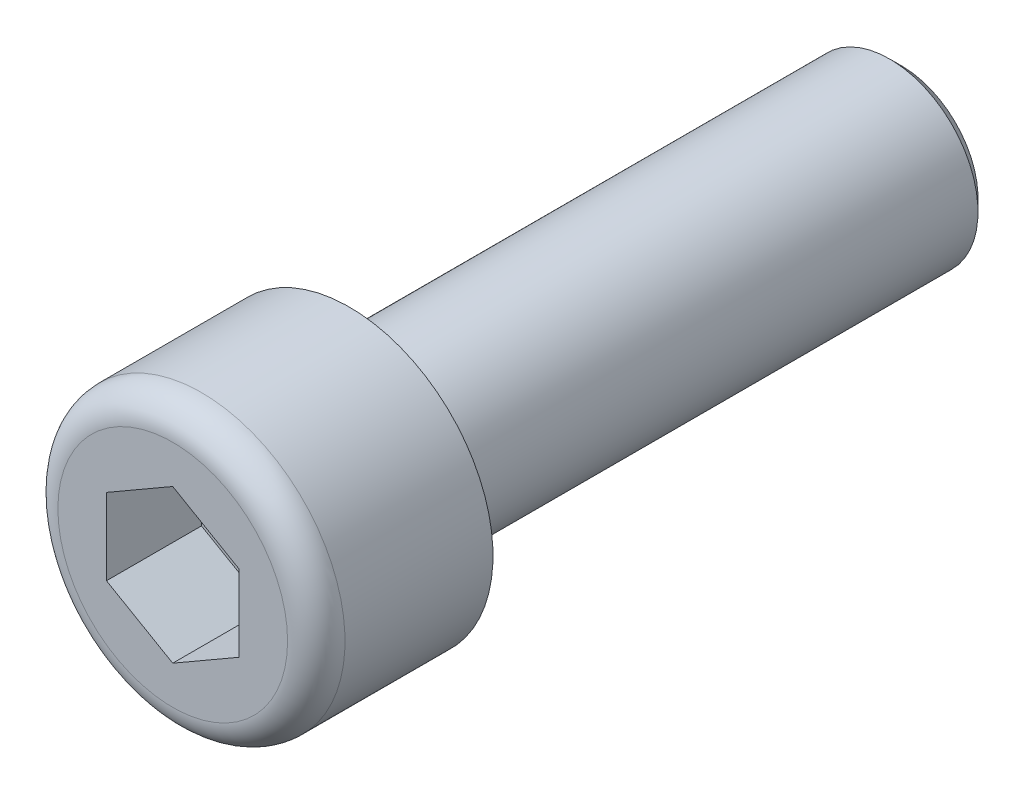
ISO-10303-21;
HEADER;
FILE_DESCRIPTION(('STEP AP214'),'2;1');
FILE_NAME('part.step','',(''),(''),'','','');
FILE_SCHEMA(('AUTOMOTIVE_DESIGN { 1 0 10303 214 1 1 1 1 }'));
ENDSEC;
DATA;
#1=APPLICATION_CONTEXT('core data for automotive mechanical design processes');
#2=APPLICATION_PROTOCOL_DEFINITION('international standard','automotive_design',2000,#1);
#3=PRODUCT_CONTEXT('',#1,'mechanical');
#4=PRODUCT('Part','Part','',(#3));
#5=PRODUCT_RELATED_PRODUCT_CATEGORY('part','',(#4));
#6=PRODUCT_DEFINITION_FORMATION('','',#4);
#7=PRODUCT_DEFINITION_CONTEXT('part definition',#1,'design');
#8=PRODUCT_DEFINITION('design','',#6,#7);
#9=PRODUCT_DEFINITION_SHAPE('','',#8);
#10=(LENGTH_UNIT() NAMED_UNIT(*) SI_UNIT(.MILLI.,.METRE.));
#11=(NAMED_UNIT(*) PLANE_ANGLE_UNIT() SI_UNIT($,.RADIAN.));
#12=(NAMED_UNIT(*) SI_UNIT($,.STERADIAN.) SOLID_ANGLE_UNIT());
#13=UNCERTAINTY_MEASURE_WITH_UNIT(LENGTH_MEASURE(1.E-05),#10,'distance_accuracy_value','');
#14=(GEOMETRIC_REPRESENTATION_CONTEXT(3) GLOBAL_UNCERTAINTY_ASSIGNED_CONTEXT((#13)) GLOBAL_UNIT_ASSIGNED_CONTEXT((#10,
#11,#12)) REPRESENTATION_CONTEXT('',''));
#15=CARTESIAN_POINT('',(0.,0.,0.));
#16=DIRECTION('',(0.,0.,1.));
#17=DIRECTION('',(1.,0.,0.));
#18=AXIS2_PLACEMENT_3D('',#15,#16,#17);
#19=CARTESIAN_POINT('',(0.,0.,0.));
#20=DIRECTION('',(0.,0.,1.));
#21=DIRECTION('',(-1.,0.,0.));
#22=AXIS2_PLACEMENT_3D('',#19,#20,#21);
#23=PLANE('',#22);
#24=CARTESIAN_POINT('',(0.,0.,0.));
#25=DIRECTION('',(0.,0.,1.));
#26=DIRECTION('',(-1.,0.,0.));
#27=AXIS2_PLACEMENT_3D('',#24,#25,#26);
#28=CIRCLE('',#27,6.5);
#29=CARTESIAN_POINT('',(-6.5,0.,0.));
#30=VERTEX_POINT('',#29);
#31=EDGE_CURVE('E107',#30,#30,#28,.T.);
#32=ORIENTED_EDGE('',*,*,#31,.F.);
#33=EDGE_LOOP('',(#32));
#34=FACE_BOUND('',#33,.T.);
#35=CARTESIAN_POINT('',(0.,0.,0.));
#36=DIRECTION('',(0.,0.,1.));
#37=DIRECTION('',(-1.,0.,0.));
#38=AXIS2_PLACEMENT_3D('',#35,#36,#37);
#39=CIRCLE('',#38,4.);
#40=CARTESIAN_POINT('',(-4.,0.,0.));
#41=VERTEX_POINT('',#40);
#42=EDGE_CURVE('E9',#41,#41,#39,.F.);
#43=ORIENTED_EDGE('',*,*,#42,.F.);
#44=EDGE_LOOP('',(#43));
#45=FACE_BOUND('',#44,.T.);
#46=ADVANCED_FACE('F14',(#34,#45),#23,.F.);
#47=CARTESIAN_POINT('',(0.,-5.2,8.));
#48=DIRECTION('',(0.,0.,-1.));
#49=DIRECTION('',(1.,0.,0.));
#50=AXIS2_PLACEMENT_3D('',#47,#48,#49);
#51=PLANE('',#50);
#52=CARTESIAN_POINT('',(0.,0.,8.));
#53=DIRECTION('',(0.,0.,1.));
#54=DIRECTION('',(-1.,0.,0.));
#55=AXIS2_PLACEMENT_3D('',#52,#53,#54);
#56=CIRCLE('',#55,5.2);
#57=CARTESIAN_POINT('',(-5.2,0.,8.));
#58=VERTEX_POINT('',#57);
#59=EDGE_CURVE('E89',#58,#58,#56,.T.);
#60=ORIENTED_EDGE('',*,*,#59,.T.);
#61=EDGE_LOOP('',(#60));
#62=FACE_BOUND('',#61,.T.);
#63=DIRECTION('',(0.,-1.,0.));
#64=VECTOR('',#63,1.);
#65=CARTESIAN_POINT('',(-3.,-5.2,8.));
#66=LINE('',#65,#64);
#67=CARTESIAN_POINT('',(-3.,1.73205080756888,8.));
#68=VERTEX_POINT('',#67);
#69=CARTESIAN_POINT('',(-3.,-1.7320508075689,8.));
#70=VERTEX_POINT('',#69);
#71=EDGE_CURVE('E23',#68,#70,#66,.T.);
#72=ORIENTED_EDGE('',*,*,#71,.F.);
#73=DIRECTION('',(-0.866025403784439,-0.5,0.));
#74=VECTOR('',#73,1.);
#75=CARTESIAN_POINT('',(-3.75166604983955,1.2980762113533,8.));
#76=LINE('',#75,#74);
#77=CARTESIAN_POINT('',(0.,3.46410161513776,8.));
#78=VERTEX_POINT('',#77);
#79=EDGE_CURVE('E38',#78,#68,#76,.T.);
#80=ORIENTED_EDGE('',*,*,#79,.F.);
#81=DIRECTION('',(-0.866025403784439,0.5,0.));
#82=VECTOR('',#81,1.);
#83=CARTESIAN_POINT('',(3.75166604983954,1.2980762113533,8.));
#84=LINE('',#83,#82);
#85=CARTESIAN_POINT('',(3.,1.73205080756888,8.));
#86=VERTEX_POINT('',#85);
#87=EDGE_CURVE('E120',#86,#78,#84,.T.);
#88=ORIENTED_EDGE('',*,*,#87,.F.);
#89=DIRECTION('',(0.,1.,0.));
#90=VECTOR('',#89,1.);
#91=CARTESIAN_POINT('',(3.,-5.2,8.));
#92=LINE('',#91,#90);
#93=CARTESIAN_POINT('',(3.,-1.7320508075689,8.));
#94=VERTEX_POINT('',#93);
#95=EDGE_CURVE('E117',#94,#86,#92,.T.);
#96=ORIENTED_EDGE('',*,*,#95,.F.);
#97=DIRECTION('',(0.866025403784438,0.5,0.));
#98=VECTOR('',#97,1.);
#99=CARTESIAN_POINT('',(-0.751666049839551,-3.8980762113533,8.));
#100=LINE('',#99,#98);
#101=CARTESIAN_POINT('',(0.,-3.46410161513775,8.));
#102=VERTEX_POINT('',#101);
#103=EDGE_CURVE('E114',#102,#94,#100,.T.);
#104=ORIENTED_EDGE('',*,*,#103,.F.);
#105=DIRECTION('',(0.866025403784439,-0.5,0.));
#106=VECTOR('',#105,1.);
#107=CARTESIAN_POINT('',(0.751666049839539,-3.8980762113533,8.));
#108=LINE('',#107,#106);
#109=EDGE_CURVE('E111',#70,#102,#108,.T.);
#110=ORIENTED_EDGE('',*,*,#109,.F.);
#111=EDGE_LOOP('',(#72,#80,#88,#96,#104,#110));
#112=FACE_BOUND('',#111,.T.);
#113=ADVANCED_FACE('F16',(#62,#112),#51,.F.);
#114=CARTESIAN_POINT('',(0.,0.,8.));
#115=DIRECTION('',(0.,0.,1.));
#116=DIRECTION('',(-1.,0.,0.));
#117=AXIS2_PLACEMENT_3D('',#114,#115,#116);
#118=CYLINDRICAL_SURFACE('',#117,6.5);
#119=CARTESIAN_POINT('',(0.,0.,6.7));
#120=DIRECTION('',(0.,0.,1.));
#121=DIRECTION('',(-1.,0.,0.));
#122=AXIS2_PLACEMENT_3D('',#119,#120,#121);
#123=CIRCLE('',#122,6.5);
#124=CARTESIAN_POINT('',(-6.5,0.,6.7));
#125=VERTEX_POINT('',#124);
#126=EDGE_CURVE('E97',#125,#125,#123,.T.);
#127=ORIENTED_EDGE('',*,*,#126,.F.);
#128=EDGE_LOOP('',(#127));
#129=FACE_BOUND('',#128,.T.);
#130=ORIENTED_EDGE('',*,*,#31,.T.);
#131=EDGE_LOOP('',(#130));
#132=FACE_BOUND('',#131,.T.);
#133=ADVANCED_FACE('F206',(#129,#132),#118,.T.);
#134=CARTESIAN_POINT('',(0.,0.,6.7));
#135=DIRECTION('',(0.,0.,1.));
#136=DIRECTION('',(-1.,0.,0.));
#137=AXIS2_PLACEMENT_3D('',#134,#135,#136);
#138=TOROIDAL_SURFACE('',#137,5.2,1.3);
#139=ORIENTED_EDGE('',*,*,#59,.F.);
#140=EDGE_LOOP('',(#139));
#141=FACE_BOUND('',#140,.T.);
#142=ORIENTED_EDGE('',*,*,#126,.T.);
#143=EDGE_LOOP('',(#142));
#144=FACE_BOUND('',#143,.T.);
#145=ADVANCED_FACE('F213',(#141,#144),#138,.T.);
#146=CARTESIAN_POINT('',(-3.,-1.7320508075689,3.7));
#147=DIRECTION('',(1.,0.,0.));
#148=DIRECTION('',(0.,-1.,0.));
#149=AXIS2_PLACEMENT_3D('',#146,#147,#148);
#150=PLANE('',#149);
#151=ORIENTED_EDGE('',*,*,#71,.T.);
#152=DIRECTION('',(0.,0.,1.));
#153=VECTOR('',#152,1.);
#154=CARTESIAN_POINT('',(-3.,-1.7320508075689,3.7));
#155=LINE('',#154,#153);
#156=CARTESIAN_POINT('',(-3.,-1.7320508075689,3.7));
#157=VERTEX_POINT('',#156);
#158=EDGE_CURVE('E30',#157,#70,#155,.T.);
#159=ORIENTED_EDGE('',*,*,#158,.F.);
#160=DIRECTION('',(0.,1.,0.));
#161=VECTOR('',#160,1.);
#162=CARTESIAN_POINT('',(-3.,-1.7320508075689,3.7));
#163=LINE('',#162,#161);
#164=CARTESIAN_POINT('',(-3.,1.73205080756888,3.7));
#165=VERTEX_POINT('',#164);
#166=EDGE_CURVE('E74',#157,#165,#163,.T.);
#167=ORIENTED_EDGE('',*,*,#166,.T.);
#168=DIRECTION('',(0.,0.,1.));
#169=VECTOR('',#168,1.);
#170=CARTESIAN_POINT('',(-3.,1.73205080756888,3.7));
#171=LINE('',#170,#169);
#172=EDGE_CURVE('E82',#165,#68,#171,.T.);
#173=ORIENTED_EDGE('',*,*,#172,.T.);
#174=EDGE_LOOP('',(#151,#159,#167,#173));
#175=FACE_BOUND('',#174,.T.);
#176=ADVANCED_FACE('F81',(#175),#150,.T.);
#177=CARTESIAN_POINT('',(-3.,1.73205080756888,3.7));
#178=DIRECTION('',(0.5,-0.866025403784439,0.));
#179=DIRECTION('',(-0.866025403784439,-0.5,0.));
#180=AXIS2_PLACEMENT_3D('',#177,#178,#179);
#181=PLANE('',#180);
#182=ORIENTED_EDGE('',*,*,#79,.T.);
#183=ORIENTED_EDGE('',*,*,#172,.F.);
#184=DIRECTION('',(0.866025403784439,0.5,0.));
#185=VECTOR('',#184,1.);
#186=CARTESIAN_POINT('',(-3.,1.73205080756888,3.7));
#187=LINE('',#186,#185);
#188=CARTESIAN_POINT('',(0.,3.46410161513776,3.7));
#189=VERTEX_POINT('',#188);
#190=EDGE_CURVE('E70',#165,#189,#187,.T.);
#191=ORIENTED_EDGE('',*,*,#190,.T.);
#192=DIRECTION('',(0.,0.,1.));
#193=VECTOR('',#192,1.);
#194=CARTESIAN_POINT('',(0.,3.46410161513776,3.7));
#195=LINE('',#194,#193);
#196=EDGE_CURVE('E90',#189,#78,#195,.T.);
#197=ORIENTED_EDGE('',*,*,#196,.T.);
#198=EDGE_LOOP('',(#182,#183,#191,#197));
#199=FACE_BOUND('',#198,.T.);
#200=ADVANCED_FACE('F87',(#199),#181,.T.);
#201=CARTESIAN_POINT('',(0.,3.46410161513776,3.7));
#202=DIRECTION('',(-0.5,-0.866025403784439,0.));
#203=DIRECTION('',(-0.866025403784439,0.5,0.));
#204=AXIS2_PLACEMENT_3D('',#201,#202,#203);
#205=PLANE('',#204);
#206=ORIENTED_EDGE('',*,*,#87,.T.);
#207=ORIENTED_EDGE('',*,*,#196,.F.);
#208=DIRECTION('',(0.866025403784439,-0.5,0.));
#209=VECTOR('',#208,1.);
#210=CARTESIAN_POINT('',(0.,3.46410161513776,3.7));
#211=LINE('',#210,#209);
#212=CARTESIAN_POINT('',(3.,1.73205080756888,3.7));
#213=VERTEX_POINT('',#212);
#214=EDGE_CURVE('E76',#189,#213,#211,.T.);
#215=ORIENTED_EDGE('',*,*,#214,.T.);
#216=DIRECTION('',(0.,0.,1.));
#217=VECTOR('',#216,1.);
#218=CARTESIAN_POINT('',(3.,1.73205080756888,3.7));
#219=LINE('',#218,#217);
#220=EDGE_CURVE('E100',#213,#86,#219,.T.);
#221=ORIENTED_EDGE('',*,*,#220,.T.);
#222=EDGE_LOOP('',(#206,#207,#215,#221));
#223=FACE_BOUND('',#222,.T.);
#224=ADVANCED_FACE('F159',(#223),#205,.T.);
#225=CARTESIAN_POINT('',(3.,1.73205080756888,3.7));
#226=DIRECTION('',(-1.,0.,0.));
#227=DIRECTION('',(0.,1.,0.));
#228=AXIS2_PLACEMENT_3D('',#225,#226,#227);
#229=PLANE('',#228);
#230=ORIENTED_EDGE('',*,*,#95,.T.);
#231=ORIENTED_EDGE('',*,*,#220,.F.);
#232=DIRECTION('',(0.,-1.,0.));
#233=VECTOR('',#232,1.);
#234=CARTESIAN_POINT('',(3.,1.73205080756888,3.7));
#235=LINE('',#234,#233);
#236=CARTESIAN_POINT('',(3.,-1.7320508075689,3.7));
#237=VERTEX_POINT('',#236);
#238=EDGE_CURVE('E162',#213,#237,#235,.T.);
#239=ORIENTED_EDGE('',*,*,#238,.T.);
#240=DIRECTION('',(0.,0.,1.));
#241=VECTOR('',#240,1.);
#242=CARTESIAN_POINT('',(3.,-1.7320508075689,3.7));
#243=LINE('',#242,#241);
#244=EDGE_CURVE('E141',#237,#94,#243,.T.);
#245=ORIENTED_EDGE('',*,*,#244,.T.);
#246=EDGE_LOOP('',(#230,#231,#239,#245));
#247=FACE_BOUND('',#246,.T.);
#248=ADVANCED_FACE('F161',(#247),#229,.T.);
#249=CARTESIAN_POINT('',(3.,-1.7320508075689,3.7));
#250=DIRECTION('',(-0.5,0.866025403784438,0.));
#251=DIRECTION('',(0.866025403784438,0.5,0.));
#252=AXIS2_PLACEMENT_3D('',#249,#250,#251);
#253=PLANE('',#252);
#254=ORIENTED_EDGE('',*,*,#103,.T.);
#255=ORIENTED_EDGE('',*,*,#244,.F.);
#256=DIRECTION('',(-0.866025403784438,-0.5,0.));
#257=VECTOR('',#256,1.);
#258=CARTESIAN_POINT('',(3.,-1.7320508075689,3.7));
#259=LINE('',#258,#257);
#260=CARTESIAN_POINT('',(0.,-3.46410161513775,3.7));
#261=VERTEX_POINT('',#260);
#262=EDGE_CURVE('E139',#237,#261,#259,.T.);
#263=ORIENTED_EDGE('',*,*,#262,.T.);
#264=DIRECTION('',(0.,0.,1.));
#265=VECTOR('',#264,1.);
#266=CARTESIAN_POINT('',(0.,-3.46410161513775,3.7));
#267=LINE('',#266,#265);
#268=EDGE_CURVE('E133',#261,#102,#267,.T.);
#269=ORIENTED_EDGE('',*,*,#268,.T.);
#270=EDGE_LOOP('',(#254,#255,#263,#269));
#271=FACE_BOUND('',#270,.T.);
#272=ADVANCED_FACE('F135',(#271),#253,.T.);
#273=CARTESIAN_POINT('',(0.,-3.46410161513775,3.7));
#274=DIRECTION('',(0.5,0.866025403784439,0.));
#275=DIRECTION('',(0.866025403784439,-0.5,0.));
#276=AXIS2_PLACEMENT_3D('',#273,#274,#275);
#277=PLANE('',#276);
#278=ORIENTED_EDGE('',*,*,#109,.T.);
#279=ORIENTED_EDGE('',*,*,#268,.F.);
#280=DIRECTION('',(-0.866025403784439,0.5,0.));
#281=VECTOR('',#280,1.);
#282=CARTESIAN_POINT('',(0.,-3.46410161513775,3.7));
#283=LINE('',#282,#281);
#284=EDGE_CURVE('E149',#261,#157,#283,.T.);
#285=ORIENTED_EDGE('',*,*,#284,.T.);
#286=ORIENTED_EDGE('',*,*,#158,.T.);
#287=EDGE_LOOP('',(#278,#279,#285,#286));
#288=FACE_BOUND('',#287,.T.);
#289=ADVANCED_FACE('F132',(#288),#277,.T.);
#290=CARTESIAN_POINT('',(-3.,-1.7320508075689,3.7));
#291=DIRECTION('',(0.,0.,1.));
#292=DIRECTION('',(1.,0.,0.));
#293=AXIS2_PLACEMENT_3D('',#290,#291,#292);
#294=PLANE('',#293);
#295=ORIENTED_EDGE('',*,*,#166,.F.);
#296=ORIENTED_EDGE('',*,*,#284,.F.);
#297=ORIENTED_EDGE('',*,*,#262,.F.);
#298=ORIENTED_EDGE('',*,*,#238,.F.);
#299=ORIENTED_EDGE('',*,*,#214,.F.);
#300=ORIENTED_EDGE('',*,*,#190,.F.);
#301=EDGE_LOOP('',(#295,#296,#297,#298,#299,#300));
#302=FACE_BOUND('',#301,.T.);
#303=ADVANCED_FACE('F72',(#302),#294,.T.);
#304=CARTESIAN_POINT('',(0.,0.,-25.));
#305=DIRECTION('',(0.,0.,1.));
#306=DIRECTION('',(-1.,0.,0.));
#307=AXIS2_PLACEMENT_3D('',#304,#305,#306);
#308=PLANE('',#307);
#309=CARTESIAN_POINT('',(0.,0.,-25.));
#310=DIRECTION('',(0.,0.,1.));
#311=DIRECTION('',(-1.,0.,0.));
#312=AXIS2_PLACEMENT_3D('',#309,#310,#311);
#313=CIRCLE('',#312,3.45875);
#314=CARTESIAN_POINT('',(-3.45875,0.,-25.));
#315=VERTEX_POINT('',#314);
#316=EDGE_CURVE('E85',#315,#315,#313,.T.);
#317=ORIENTED_EDGE('',*,*,#316,.F.);
#318=EDGE_LOOP('',(#317));
#319=FACE_BOUND('',#318,.T.);
#320=ADVANCED_FACE('F188',(#319),#308,.F.);
#321=CARTESIAN_POINT('',(0.,0.,-25.));
#322=DIRECTION('',(0.,0.,1.));
#323=DIRECTION('',(-1.,0.,0.));
#324=AXIS2_PLACEMENT_3D('',#321,#322,#323);
#325=CONICAL_SURFACE('',#324,3.45875,0.785398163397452);
#326=CARTESIAN_POINT('',(0.,0.,-24.45875));
#327=DIRECTION('',(0.,0.,1.));
#328=DIRECTION('',(-1.,0.,0.));
#329=AXIS2_PLACEMENT_3D('',#326,#327,#328);
#330=CIRCLE('',#329,4.);
#331=CARTESIAN_POINT('',(-4.,0.,-24.45875));
#332=VERTEX_POINT('',#331);
#333=EDGE_CURVE('E175',#332,#332,#330,.T.);
#334=ORIENTED_EDGE('',*,*,#333,.F.);
#335=EDGE_LOOP('',(#334));
#336=FACE_BOUND('',#335,.T.);
#337=ORIENTED_EDGE('',*,*,#316,.T.);
#338=EDGE_LOOP('',(#337));
#339=FACE_BOUND('',#338,.T.);
#340=ADVANCED_FACE('F185',(#336,#339),#325,.T.);
#341=CARTESIAN_POINT('',(0.,0.,0.));
#342=DIRECTION('',(0.,0.,1.));
#343=DIRECTION('',(-1.,0.,0.));
#344=AXIS2_PLACEMENT_3D('',#341,#342,#343);
#345=CYLINDRICAL_SURFACE('',#344,4.);
#346=ORIENTED_EDGE('',*,*,#42,.T.);
#347=EDGE_LOOP('',(#346));
#348=FACE_BOUND('',#347,.T.);
#349=ORIENTED_EDGE('',*,*,#333,.T.);
#350=EDGE_LOOP('',(#349));
#351=FACE_BOUND('',#350,.T.);
#352=ADVANCED_FACE('F183',(#348,#351),#345,.T.);
#353=CLOSED_SHELL('',(#46,#113,#133,#145,#176,#200,#224,#248,#272,#289,#303,#320,#340,#352));
#354=MANIFOLD_SOLID_BREP('B1',#353);
#355=ADVANCED_BREP_SHAPE_REPRESENTATION('',(#18,#354),#14);
#356=SHAPE_DEFINITION_REPRESENTATION(#9,#355);
ENDSEC;
END-ISO-10303-21;
